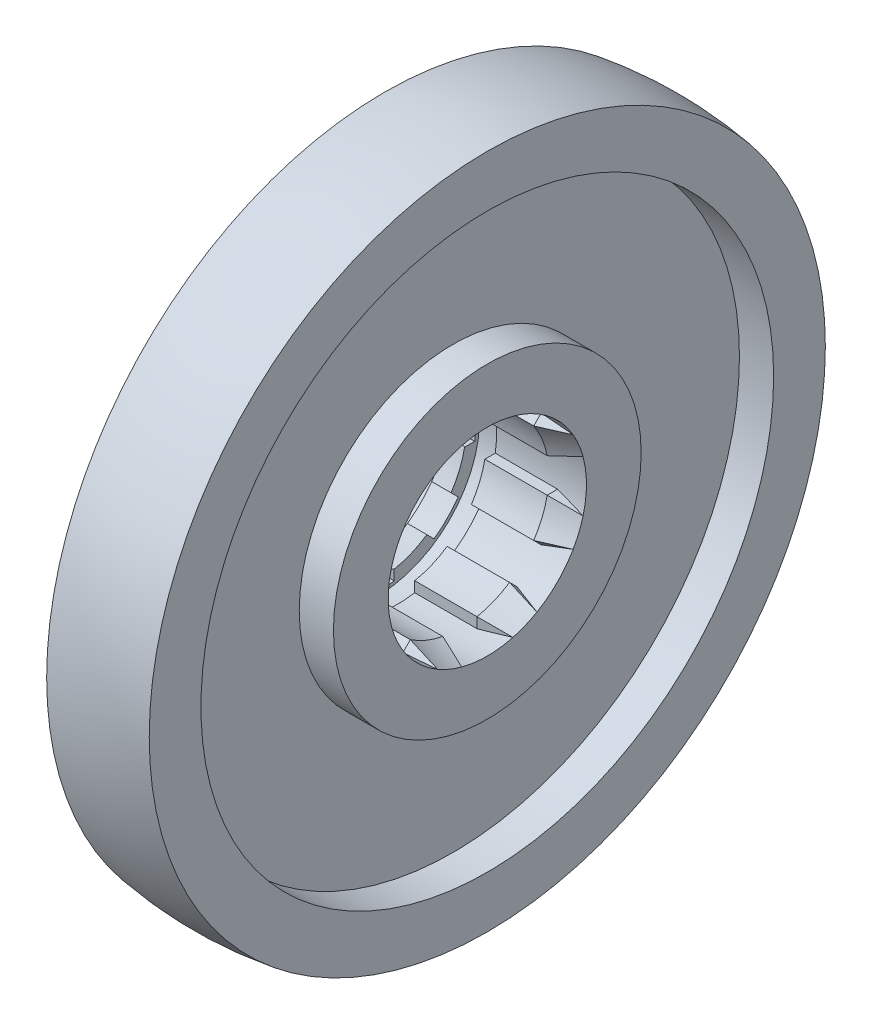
from build123d import *
from OCP.BRepFilletAPI import BRepFilletAPI_MakeChamfer

# Parameters (mm, degrees)
SCHNITT_LINEAR_AUSTRAGEN1_DEPTH             = 147.96938456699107
FASE3_SIZE                                  = 2.5
FASE3_SIZE2                                 = 8
FASE4_SIZE                                  = 2.5
FASE4_SIZE2                                 = 8
KREISMUSTER1_COUNT                          = 8
FASE3_OF_KREISMUSTER1_SIZE2                 = 8
FASE3_OF_KREISMUSTER1_SIZE                  = 2.5
FASE4_OF_KREISMUSTER1_SIZE2                 = 8
FASE4_OF_KREISMUSTER1_SIZE                  = 2.5
FASE5_SIZE                                  = 3
FASE5_SIZE2                                 = 8
FASE6_SIZE                                  = 8
FASE6_SIZE2                                 = 3
SCHNITT_LINEAR_AUSTRAGEN2_REACH             = 150.408
SCHNITT_LINEAR_AUSTRAGEN2_DIRECTION_2_REACH = 150.408
M6X1_0_GEWINDEKERNLOCH1_D                   = 5
M6X1_0_GEWINDEKERNLOCH1_DEPTH               = 17
M6X1_0_GEWINDEKERNLOCH1_CBORE_D             = 6
M6X1_0_GEWINDEKERNLOCH1_CBORE_DEPTH         = 12
M6X1_0_GEWINDEKERNLOCH1_TIP                 = 2.5000000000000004


with BuildPart() as part:
    # Skizze1 → Rotation1 (revolve)
    with BuildSketch(Plane.XY, mode=Mode.PRIVATE) as rotation1_sk:
        with BuildLine():
            Line((-44.99999999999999, 30.999999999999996), (-24.99999999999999, 30.999999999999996))
            Line((-24.99999999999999, 30.999999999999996), (-24.99999999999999, 26))
            Line((-24.99999999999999, 26), (15.000000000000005, 26))
            Line((15.000000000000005, 26), (15.000000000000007, 45))
            Line((15.000000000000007, 45), (5.000000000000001, 45))
            Line((5.000000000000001, 45), (5, 83.75))
            Line((5, 83.75), (15, 83.75000000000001))
            Line((15, 83.75000000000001), (14.999999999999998, 98.86859966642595))
            ThreePointArc((14.999999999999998, 98.86859966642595), (6.12e-15, 100.00000000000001), (-15, 98.86859966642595))
            Line((-15, 98.86859966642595), (-15, 83.75000000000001))
            Line((-15, 83.75000000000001), (-5, 83.75))
            Line((-5, 83.75), (-5.000000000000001, 45))
            Line((-5.000000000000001, 45), (-29.999999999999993, 44.99999999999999))
            Line((-29.999999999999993, 44.99999999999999), (-29.999999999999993, 39.99999999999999))
            Line((-29.999999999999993, 39.99999999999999), (-39.99999999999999, 39.99999999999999))
            Line((-39.99999999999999, 39.99999999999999), (-39.99999999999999, 44.99999999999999))
            Line((-39.99999999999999, 44.99999999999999), (-44.99999999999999, 44.99999999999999))
            Line((-44.99999999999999, 44.99999999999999), (-44.99999999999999, 30.999999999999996))
        make_face()
    revolve(rotation1_sk.sketch.rotate(Axis((0, 0, 0), (-1, 0, 0)), 90), axis=Axis((0, 0, 0), (-1, 0, 0)))

    # Skizze2 → Schnitt-Linear austragen1 (cut, through all)
    with BuildSketch(Plane.ZY.offset(24.99999999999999)):
        with BuildLine():
            Line((0, 29), (0, 26))
            ThreePointArc((3.4798e-13, 26), (2.5117481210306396, 25.878391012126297), (4.999999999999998, 25.514701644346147))
            Line((5.000000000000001, 25.51470164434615), (5, 28.565713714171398))
            ThreePointArc((5, 28.565713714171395), (2.509412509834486, 28.89122442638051), (-3.5372e-13, 29))
        make_face()
        with BuildLine():
            ThreePointArc((-5.000000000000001, 25.514701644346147), (-2.5117481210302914, 25.87839101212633), (3.4798e-13, 26))
            Line((0, 26), (0, 29))
            ThreePointArc((-3.5372e-13, 29), (-2.5094125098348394, 28.891224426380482), (-5, 28.565713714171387))
            Line((-5, 28.565713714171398), (-5.000000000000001, 25.51470164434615))
        make_face()
    schnitt_linear_austragen1 = extrude(amount=-SCHNITT_LINEAR_AUSTRAGEN1_DEPTH, mode=Mode.SUBTRACT)

    # Fase3
    fase3_edges = [part.edges().sort_by_distance(p)[0] for p in [
        (15.000000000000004, 27.04020767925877, -5),
    ]]
    fase3_side = [part.faces().sort_by_distance(p)[0] for p in [
        (15.000000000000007, -1.021e-14, 43.72720779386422),
    ]]
    chamfer(fase3_edges, length=FASE3_SIZE, length2=FASE3_SIZE2, reference=fase3_side[0])

    # Fase4
    fase4_edges = [part.edges().sort_by_distance(p)[0] for p in [
        (15.000000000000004, 27.04020767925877, 5),
    ]]
    fase4_side = [part.faces().sort_by_distance(p)[0] for p in [
        (15.000000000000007, -27.239314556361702, 1.3509023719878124),
    ]]
    chamfer(fase4_edges, length=FASE4_SIZE, length2=FASE4_SIZE2, reference=fase4_side[0])

    # Kreismuster1: Schnitt-Linear austragen1 ×8 about axis
    kreismuster1_axis = Axis((0, -1.65e-15, 4.43e-15), (1, 0, 0))
    for i in range(1, KREISMUSTER1_COUNT):
        add(schnitt_linear_austragen1.rotate(kreismuster1_axis, i * 360 / KREISMUSTER1_COUNT), mode=Mode.SUBTRACT)

    # Fase3 of Kreismuster1
    fase3_of_kreismuster1_edges = [part.edges().sort_by_distance(p)[0] for p in [
        (15.000000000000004, 22.655848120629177, 15.584780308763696),
        (15.000000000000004, 5.000000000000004, 27.040207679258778),
        (15.000000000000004, -15.584780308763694, 22.65584812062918),
        (15.000000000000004, -27.040207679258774, 5.000000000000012),
        (15.000000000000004, -22.655848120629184, -15.584780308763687),
        (15.000000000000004, -5.0000000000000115, -27.040207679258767),
        (15.000000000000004, 15.584780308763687, -22.655848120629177),
    ]]
    chamfer(fase3_of_kreismuster1_edges, length=FASE3_OF_KREISMUSTER1_SIZE, length2=FASE3_OF_KREISMUSTER1_SIZE2)

    # Fase4 of Kreismuster1
    fase4_of_kreismuster1_edges = [part.edges().sort_by_distance(p)[0] for p in [
        (15.000000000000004, 15.5847803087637, 22.655848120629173),
        (15.000000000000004, -4.999999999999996, 27.040207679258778),
        (15.000000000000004, -22.65584812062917, 15.584780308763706),
        (15.000000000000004, -27.040207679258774, -4.999999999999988),
        (15.000000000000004, -15.584780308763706, -22.655848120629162),
        (15.000000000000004, 4.9999999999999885, -27.040207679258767),
        (15.000000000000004, 22.655848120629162, -15.584780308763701),
    ]]
    chamfer(fase4_of_kreismuster1_edges, length=FASE4_OF_KREISMUSTER1_SIZE, length2=FASE4_OF_KREISMUSTER1_SIZE2)

    # Fase5
    fase5_edges = [part.edges().sort_by_distance(p)[0] for p in [
        (15.000000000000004, 9.949769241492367, 24.02086784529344),
        (15.000000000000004, -9.9497692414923, 24.020867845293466),
        (15.000000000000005, -24.02086784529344, 9.949769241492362),
        (15.000000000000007, -24.02086784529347, -9.949769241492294),
        (15.000000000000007, -9.949769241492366, -24.02086784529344),
        (15.000000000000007, 9.94976924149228, -24.020867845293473),
        (15.000000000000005, 24.02086784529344, -9.949769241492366),
        (15.000000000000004, 24.020867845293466, 9.949769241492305),
    ]]
    fase5_side = [part.faces().sort_by_distance(p)[0] for p in [
        (15.000000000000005, 25.19677451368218, -10.436845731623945),
    ]]
    chamfer(fase5_edges, length=FASE5_SIZE, length2=FASE5_SIZE2, reference=fase5_side[0])

    # Fase6: one chamfer whose edges measure the first distance from different faces: ONE call of the kernel's chamfer builder (chamfer() names one face for all edges)
    fase6_edges_1 = [part.edges().sort_by_distance(p)[0] for p in [
        (-24.99999999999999, -24.02086784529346, -9.949769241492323),
    ]]
    fase6_side_1 = [part.faces().sort_by_distance(p)[0] for p in [
        (-8.999999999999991, -24.02086784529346, -9.949769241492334),
    ]]
    fase6_edges_2 = [part.edges().sort_by_distance(p)[0] for p in [
        (-24.99999999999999, -9.949769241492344, -24.020867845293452),
    ]]
    fase6_side_2 = [part.faces().sort_by_distance(p)[0] for p in [
        (-8.999999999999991, -9.949769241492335, -24.020867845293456),
    ]]
    fase6_edges_3 = [part.edges().sort_by_distance(p)[0] for p in [
        (-24.99999999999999, 9.949769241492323, -24.02086784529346),
    ]]
    fase6_side_3 = [part.faces().sort_by_distance(p)[0] for p in [
        (-8.999999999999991, 9.949769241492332, -24.02086784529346),
    ]]
    fase6_edges_4 = [part.edges().sort_by_distance(p)[0] for p in [
        (-24.99999999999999, 24.020867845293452, -9.949769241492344),
    ]]
    fase6_side_4 = [part.faces().sort_by_distance(p)[0] for p in [
        (-8.999999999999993, 24.020867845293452, -9.949769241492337),
    ]]
    fase6_edges_5 = [part.edges().sort_by_distance(p)[0] for p in [
        (-24.99999999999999, 24.020867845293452, 9.94976924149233),
    ]]
    fase6_side_5 = [part.faces().sort_by_distance(p)[0] for p in [
        (-8.999999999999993, 24.020867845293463, 9.949769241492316),
    ]]
    fase6_edges_6 = [part.edges().sort_by_distance(p)[0] for p in [
        (-24.99999999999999, 9.949769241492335, 24.020867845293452),
    ]]
    fase6_side_6 = [part.faces().sort_by_distance(p)[0] for p in [
        (-8.999999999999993, 9.949769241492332, 24.020867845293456),
    ]]
    fase6_edges_7 = [part.edges().sort_by_distance(p)[0] for p in [
        (-24.99999999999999, -9.949769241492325, 24.02086784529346),
    ]]
    fase6_side_7 = [part.faces().sort_by_distance(p)[0] for p in [
        (-8.999999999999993, -9.949769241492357, 24.020867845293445),
    ]]
    fase6_edges_8 = [part.edges().sort_by_distance(p)[0] for p in [
        (-24.99999999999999, -24.020867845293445, 9.949769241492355),
    ]]
    fase6_side_8 = [part.faces().sort_by_distance(p)[0] for p in [
        (-8.999999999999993, -24.020867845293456, 9.949769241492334),
    ]]
    fase6 = BRepFilletAPI_MakeChamfer(part.part.solid().wrapped)
    for e in fase6_edges_1:
        fase6.Add(FASE6_SIZE, FASE6_SIZE2, e.wrapped, fase6_side_1[0].wrapped)  # the first distance lies on this face
    for e in fase6_edges_2:
        fase6.Add(FASE6_SIZE, FASE6_SIZE2, e.wrapped, fase6_side_2[0].wrapped)  # the first distance lies on this face
    for e in fase6_edges_3:
        fase6.Add(FASE6_SIZE, FASE6_SIZE2, e.wrapped, fase6_side_3[0].wrapped)  # the first distance lies on this face
    for e in fase6_edges_4:
        fase6.Add(FASE6_SIZE, FASE6_SIZE2, e.wrapped, fase6_side_4[0].wrapped)  # the first distance lies on this face
    for e in fase6_edges_5:
        fase6.Add(FASE6_SIZE, FASE6_SIZE2, e.wrapped, fase6_side_5[0].wrapped)  # the first distance lies on this face
    for e in fase6_edges_6:
        fase6.Add(FASE6_SIZE, FASE6_SIZE2, e.wrapped, fase6_side_6[0].wrapped)  # the first distance lies on this face
    for e in fase6_edges_7:
        fase6.Add(FASE6_SIZE, FASE6_SIZE2, e.wrapped, fase6_side_7[0].wrapped)  # the first distance lies on this face
    for e in fase6_edges_8:
        fase6.Add(FASE6_SIZE, FASE6_SIZE2, e.wrapped, fase6_side_8[0].wrapped)  # the first distance lies on this face
    add(Compound.cast(fase6.Shape()), mode=Mode.REPLACE)

    # Skizze4 → Schnitt-Linear austragen2 (cut, up to next)
    with BuildSketch(Plane.XY, mode=Mode.PRIVATE) as schnitt_linear_austragen2_sk1:
        Polygon((-14.999999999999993, 45), (-29.999999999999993, 40.99999999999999), (-29.999999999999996, 45), align=None)
    schnitt_linear_austragen2_tool1 = extrude(schnitt_linear_austragen2_sk1.sketch, amount=-SCHNITT_LINEAR_AUSTRAGEN2_REACH, mode=Mode.PRIVATE) & part.part
    add(schnitt_linear_austragen2_tool1.solids().sort_by_distance((-25, 43.666667, 0))[0], mode=Mode.SUBTRACT)

    # Skizze4 → Schnitt-Linear austragen2 direction 2 (cut, up to next)
    with BuildSketch(Plane.XY, mode=Mode.PRIVATE) as schnitt_linear_austragen2_direction_2_sk1:
        Polygon((-14.999999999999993, 45), (-29.999999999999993, 40.99999999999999), (-29.999999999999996, 45), align=None)
    schnitt_linear_austragen2_direction_2_tool1 = extrude(schnitt_linear_austragen2_direction_2_sk1.sketch, amount=SCHNITT_LINEAR_AUSTRAGEN2_DIRECTION_2_REACH, mode=Mode.PRIVATE) & part.part
    add(schnitt_linear_austragen2_direction_2_tool1.solids().sort_by_distance((-25, 43.666667, 0))[0], mode=Mode.SUBTRACT)

    # M6x1.0 Gewindekernloch1
    with Locations(Plane(origin=(-12.199170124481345, 45.746887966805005, 0), x_dir=(-0.9662349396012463, -0.25766265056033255, 0), z_dir=(-0.25766265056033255, 0.9662349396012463, 0))):
        with Locations((6.422879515, 0)):
            CounterBoreHole(M6X1_0_GEWINDEKERNLOCH1_D / 2, M6X1_0_GEWINDEKERNLOCH1_CBORE_D / 2, M6X1_0_GEWINDEKERNLOCH1_CBORE_DEPTH, depth=M6X1_0_GEWINDEKERNLOCH1_DEPTH)
            with Locations((0, 0, -(M6X1_0_GEWINDEKERNLOCH1_DEPTH + M6X1_0_GEWINDEKERNLOCH1_TIP / 2))):  # 90° drill point
                Cone(0, M6X1_0_GEWINDEKERNLOCH1_D / 2, M6X1_0_GEWINDEKERNLOCH1_TIP, mode=Mode.SUBTRACT)

    # Skizze8 → Schnitt-Rotation1 (revolve, cut)
    with BuildSketch(Plane.XY):
        Polygon((-17.234689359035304, 30), (-17.2346893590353, 0), (-11.234689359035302, 0), (-11.234689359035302, 30), align=None)
    revolve(axis=Axis((-47.99999999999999, 0, 0), (1, 0, 0)), mode=Mode.SUBTRACT)


solid = part.part
